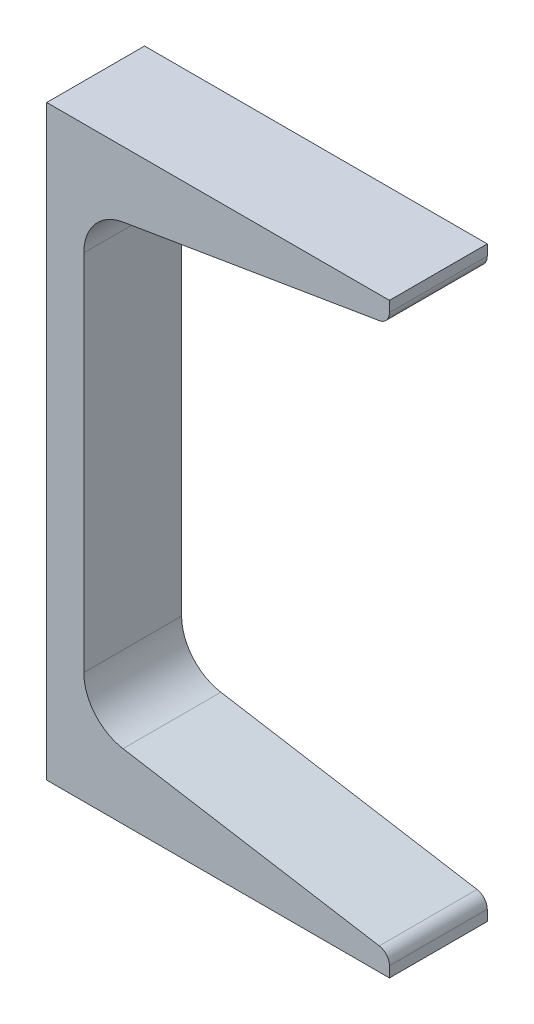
ISO-10303-21;
HEADER;
FILE_DESCRIPTION(('STEP AP214'),'2;1');
FILE_NAME('part.step','',(''),(''),'','','');
FILE_SCHEMA(('AUTOMOTIVE_DESIGN { 1 0 10303 214 1 1 1 1 }'));
ENDSEC;
DATA;
#1=APPLICATION_CONTEXT('core data for automotive mechanical design processes');
#2=APPLICATION_PROTOCOL_DEFINITION('international standard','automotive_design',2000,#1);
#3=PRODUCT_CONTEXT('',#1,'mechanical');
#4=PRODUCT('Part','Part','',(#3));
#5=PRODUCT_RELATED_PRODUCT_CATEGORY('part','',(#4));
#6=PRODUCT_DEFINITION_FORMATION('','',#4);
#7=PRODUCT_DEFINITION_CONTEXT('part definition',#1,'design');
#8=PRODUCT_DEFINITION('design','',#6,#7);
#9=PRODUCT_DEFINITION_SHAPE('','',#8);
#10=(LENGTH_UNIT() NAMED_UNIT(*) SI_UNIT(.MILLI.,.METRE.));
#11=(NAMED_UNIT(*) PLANE_ANGLE_UNIT() SI_UNIT($,.RADIAN.));
#12=(NAMED_UNIT(*) SI_UNIT($,.STERADIAN.) SOLID_ANGLE_UNIT());
#13=UNCERTAINTY_MEASURE_WITH_UNIT(LENGTH_MEASURE(1.E-05),#10,'distance_accuracy_value','');
#14=(GEOMETRIC_REPRESENTATION_CONTEXT(3) GLOBAL_UNCERTAINTY_ASSIGNED_CONTEXT((#13)) GLOBAL_UNIT_ASSIGNED_CONTEXT((#10,
#11,#12)) REPRESENTATION_CONTEXT('',''));
#15=CARTESIAN_POINT('',(0.,0.,0.));
#16=DIRECTION('',(0.,0.,1.));
#17=DIRECTION('',(1.,0.,0.));
#18=AXIS2_PLACEMENT_3D('',#15,#16,#17);
#19=CARTESIAN_POINT('',(0.,152.4,12.7));
#20=DIRECTION('',(1.,0.,0.));
#21=DIRECTION('',(0.,0.,-1.));
#22=AXIS2_PLACEMENT_3D('',#19,#20,#21);
#23=PLANE('',#22);
#24=DIRECTION('',(0.,-1.,0.));
#25=VECTOR('',#24,1.);
#26=CARTESIAN_POINT('',(0.,152.4,-12.7));
#27=LINE('',#26,#25);
#28=CARTESIAN_POINT('',(0.,152.4,-12.7));
#29=VERTEX_POINT('',#28);
#30=CARTESIAN_POINT('',(0.,0.,-12.7));
#31=VERTEX_POINT('',#30);
#32=EDGE_CURVE('E144',#29,#31,#27,.T.);
#33=ORIENTED_EDGE('',*,*,#32,.T.);
#34=DIRECTION('',(0.,0.,-1.));
#35=VECTOR('',#34,1.);
#36=CARTESIAN_POINT('',(0.,0.,12.7));
#37=LINE('',#36,#35);
#38=CARTESIAN_POINT('',(0.,0.,12.7));
#39=VERTEX_POINT('',#38);
#40=EDGE_CURVE('E142',#39,#31,#37,.T.);
#41=ORIENTED_EDGE('',*,*,#40,.F.);
#42=DIRECTION('',(0.,-1.,0.));
#43=VECTOR('',#42,1.);
#44=CARTESIAN_POINT('',(0.,152.4,12.7));
#45=LINE('',#44,#43);
#46=CARTESIAN_POINT('',(0.,152.4,12.7));
#47=VERTEX_POINT('',#46);
#48=EDGE_CURVE('E128',#47,#39,#45,.T.);
#49=ORIENTED_EDGE('',*,*,#48,.F.);
#50=DIRECTION('',(0.,0.,-1.));
#51=VECTOR('',#50,1.);
#52=CARTESIAN_POINT('',(0.,152.4,12.7));
#53=LINE('',#52,#51);
#54=EDGE_CURVE('E173',#47,#29,#53,.T.);
#55=ORIENTED_EDGE('',*,*,#54,.T.);
#56=EDGE_LOOP('',(#33,#41,#49,#55));
#57=FACE_BOUND('',#56,.T.);
#58=ADVANCED_FACE('F39',(#57),#23,.F.);
#59=CARTESIAN_POINT('',(89.0016,0.,12.7));
#60=DIRECTION('',(0.,-1.,0.));
#61=DIRECTION('',(1.,0.,0.));
#62=AXIS2_PLACEMENT_3D('',#59,#60,#61);
#63=PLANE('',#62);
#64=DIRECTION('',(-1.,0.,0.));
#65=VECTOR('',#64,1.);
#66=CARTESIAN_POINT('',(89.0016,0.,-12.7));
#67=LINE('',#66,#65);
#68=CARTESIAN_POINT('',(89.0016,0.,-12.7));
#69=VERTEX_POINT('',#68);
#70=EDGE_CURVE('E175',#69,#31,#67,.T.);
#71=ORIENTED_EDGE('',*,*,#70,.F.);
#72=DIRECTION('',(0.,0.,-1.));
#73=VECTOR('',#72,1.);
#74=CARTESIAN_POINT('',(89.0016,0.,12.7));
#75=LINE('',#74,#73);
#76=CARTESIAN_POINT('',(89.0016,0.,12.7));
#77=VERTEX_POINT('',#76);
#78=EDGE_CURVE('E149',#77,#69,#75,.T.);
#79=ORIENTED_EDGE('',*,*,#78,.F.);
#80=DIRECTION('',(-1.,0.,0.));
#81=VECTOR('',#80,1.);
#82=CARTESIAN_POINT('',(89.0016,0.,12.7));
#83=LINE('',#82,#81);
#84=EDGE_CURVE('E133',#77,#39,#83,.T.);
#85=ORIENTED_EDGE('',*,*,#84,.T.);
#86=ORIENTED_EDGE('',*,*,#40,.T.);
#87=EDGE_LOOP('',(#71,#79,#85,#86));
#88=FACE_BOUND('',#87,.T.);
#89=ADVANCED_FACE('F151',(#88),#63,.T.);
#90=CARTESIAN_POINT('',(89.0016,0.,12.7));
#91=DIRECTION('',(-1.,0.,0.));
#92=DIRECTION('',(0.,-1.,0.));
#93=AXIS2_PLACEMENT_3D('',#90,#91,#92);
#94=PLANE('',#93);
#95=DIRECTION('',(0.,1.,0.));
#96=VECTOR('',#95,1.);
#97=CARTESIAN_POINT('',(89.0016,0.,-12.7));
#98=LINE('',#97,#96);
#99=CARTESIAN_POINT('',(89.0016,2.76033787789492,-12.7));
#100=VERTEX_POINT('',#99);
#101=EDGE_CURVE('E177',#69,#100,#98,.T.);
#102=ORIENTED_EDGE('',*,*,#101,.T.);
#103=DIRECTION('',(0.,0.,-1.));
#104=VECTOR('',#103,1.);
#105=CARTESIAN_POINT('',(89.0016,2.76033787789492,12.7));
#106=LINE('',#105,#104);
#107=CARTESIAN_POINT('',(89.0016,2.76033787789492,12.7));
#108=VERTEX_POINT('',#107);
#109=EDGE_CURVE('E216',#100,#108,#106,.F.);
#110=ORIENTED_EDGE('',*,*,#109,.T.);
#111=DIRECTION('',(0.,1.,0.));
#112=VECTOR('',#111,1.);
#113=CARTESIAN_POINT('',(89.0016,0.,12.7));
#114=LINE('',#113,#112);
#115=EDGE_CURVE('E153',#77,#108,#114,.T.);
#116=ORIENTED_EDGE('',*,*,#115,.F.);
#117=ORIENTED_EDGE('',*,*,#78,.T.);
#118=EDGE_LOOP('',(#102,#110,#116,#117));
#119=FACE_BOUND('',#118,.T.);
#120=ADVANCED_FACE('F249',(#119),#94,.F.);
#121=CARTESIAN_POINT('',(19.8141052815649,16.9820244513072,12.7));
#122=DIRECTION('',(0.164410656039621,0.986391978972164,0.));
#123=DIRECTION('',(-0.986391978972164,0.164410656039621,0.));
#124=AXIS2_PLACEMENT_3D('',#121,#122,#123);
#125=PLANE('',#124);
#126=DIRECTION('',(0.986391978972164,-0.164410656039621,0.));
#127=VECTOR('',#126,1.);
#128=CARTESIAN_POINT('',(19.8141052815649,16.9820244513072,12.7));
#129=LINE('',#128,#127);
#130=CARTESIAN_POINT('',(19.8141052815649,16.9820244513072,12.7));
#131=VERTEX_POINT('',#130);
#132=CARTESIAN_POINT('',(86.3486038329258,5.89213241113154,12.7));
#133=VERTEX_POINT('',#132);
#134=EDGE_CURVE('E155',#131,#133,#129,.T.);
#135=ORIENTED_EDGE('',*,*,#134,.T.);
#136=DIRECTION('',(0.,0.,-1.));
#137=VECTOR('',#136,1.);
#138=CARTESIAN_POINT('',(86.3486038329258,5.89213241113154,-12.7));
#139=LINE('',#138,#137);
#140=CARTESIAN_POINT('',(86.3486038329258,5.89213241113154,-12.7));
#141=VERTEX_POINT('',#140);
#142=EDGE_CURVE('E148',#133,#141,#139,.T.);
#143=ORIENTED_EDGE('',*,*,#142,.T.);
#144=DIRECTION('',(0.986391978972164,-0.164410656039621,0.));
#145=VECTOR('',#144,1.);
#146=CARTESIAN_POINT('',(19.8141052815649,16.9820244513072,-12.7));
#147=LINE('',#146,#145);
#148=CARTESIAN_POINT('',(19.8141052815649,16.9820244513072,-12.7));
#149=VERTEX_POINT('',#148);
#150=EDGE_CURVE('E180',#149,#141,#147,.T.);
#151=ORIENTED_EDGE('',*,*,#150,.F.);
#152=DIRECTION('',(0.,0.,-1.));
#153=VECTOR('',#152,1.);
#154=CARTESIAN_POINT('',(19.8141052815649,16.9820244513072,12.7));
#155=LINE('',#154,#153);
#156=EDGE_CURVE('E207',#131,#149,#155,.T.);
#157=ORIENTED_EDGE('',*,*,#156,.F.);
#158=EDGE_LOOP('',(#135,#143,#151,#157));
#159=FACE_BOUND('',#158,.T.);
#160=ADVANCED_FACE('F265',(#159),#125,.T.);
#161=CARTESIAN_POINT('',(21.8186,29.0081154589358,12.7));
#162=DIRECTION('',(0.,0.,-1.));
#163=DIRECTION('',(-1.,0.,0.));
#164=AXIS2_PLACEMENT_3D('',#161,#162,#163);
#165=CYLINDRICAL_SURFACE('',#164,12.192);
#166=CARTESIAN_POINT('',(21.8186,29.0081154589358,-12.7));
#167=DIRECTION('',(0.,0.,1.));
#168=DIRECTION('',(1.,0.,0.));
#169=AXIS2_PLACEMENT_3D('',#166,#167,#168);
#170=CIRCLE('',#169,12.192);
#171=CARTESIAN_POINT('',(9.62660000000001,29.0081154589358,-12.7));
#172=VERTEX_POINT('',#171);
#173=EDGE_CURVE('E183',#172,#149,#170,.T.);
#174=ORIENTED_EDGE('',*,*,#173,.F.);
#175=DIRECTION('',(0.,0.,-1.));
#176=VECTOR('',#175,1.);
#177=CARTESIAN_POINT('',(9.62660000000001,29.0081154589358,12.7));
#178=LINE('',#177,#176);
#179=CARTESIAN_POINT('',(9.62660000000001,29.0081154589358,12.7));
#180=VERTEX_POINT('',#179);
#181=EDGE_CURVE('E205',#180,#172,#178,.T.);
#182=ORIENTED_EDGE('',*,*,#181,.F.);
#183=CARTESIAN_POINT('',(21.8186,29.0081154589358,12.7));
#184=DIRECTION('',(0.,0.,1.));
#185=DIRECTION('',(1.,0.,0.));
#186=AXIS2_PLACEMENT_3D('',#183,#184,#185);
#187=CIRCLE('',#186,12.192);
#188=EDGE_CURVE('E160',#180,#131,#187,.T.);
#189=ORIENTED_EDGE('',*,*,#188,.T.);
#190=ORIENTED_EDGE('',*,*,#156,.T.);
#191=EDGE_LOOP('',(#174,#182,#189,#190));
#192=FACE_BOUND('',#191,.T.);
#193=ADVANCED_FACE('F269',(#192),#165,.F.);
#194=CARTESIAN_POINT('',(9.62660000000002,123.391884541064,12.7));
#195=DIRECTION('',(1.,0.,0.));
#196=DIRECTION('',(0.,1.,0.));
#197=AXIS2_PLACEMENT_3D('',#194,#195,#196);
#198=PLANE('',#197);
#199=DIRECTION('',(0.,-1.,0.));
#200=VECTOR('',#199,1.);
#201=CARTESIAN_POINT('',(9.62660000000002,123.391884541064,-12.7));
#202=LINE('',#201,#200);
#203=CARTESIAN_POINT('',(9.62660000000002,123.391884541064,-12.7));
#204=VERTEX_POINT('',#203);
#205=EDGE_CURVE('E186',#204,#172,#202,.T.);
#206=ORIENTED_EDGE('',*,*,#205,.F.);
#207=DIRECTION('',(0.,0.,-1.));
#208=VECTOR('',#207,1.);
#209=CARTESIAN_POINT('',(9.62660000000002,123.391884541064,12.7));
#210=LINE('',#209,#208);
#211=CARTESIAN_POINT('',(9.62660000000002,123.391884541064,12.7));
#212=VERTEX_POINT('',#211);
#213=EDGE_CURVE('E203',#212,#204,#210,.T.);
#214=ORIENTED_EDGE('',*,*,#213,.F.);
#215=DIRECTION('',(0.,-1.,0.));
#216=VECTOR('',#215,1.);
#217=CARTESIAN_POINT('',(9.62660000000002,123.391884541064,12.7));
#218=LINE('',#217,#216);
#219=EDGE_CURVE('E163',#212,#180,#218,.T.);
#220=ORIENTED_EDGE('',*,*,#219,.T.);
#221=ORIENTED_EDGE('',*,*,#181,.T.);
#222=EDGE_LOOP('',(#206,#214,#220,#221));
#223=FACE_BOUND('',#222,.T.);
#224=ADVANCED_FACE('F273',(#223),#198,.T.);
#225=CARTESIAN_POINT('',(21.8186,123.391884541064,12.7));
#226=DIRECTION('',(0.,0.,-1.));
#227=DIRECTION('',(-1.,0.,0.));
#228=AXIS2_PLACEMENT_3D('',#225,#226,#227);
#229=CYLINDRICAL_SURFACE('',#228,12.192);
#230=CARTESIAN_POINT('',(21.8186,123.391884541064,-12.7));
#231=DIRECTION('',(0.,0.,-1.));
#232=DIRECTION('',(-1.,0.,0.));
#233=AXIS2_PLACEMENT_3D('',#230,#231,#232);
#234=CIRCLE('',#233,12.192);
#235=CARTESIAN_POINT('',(19.8141052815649,135.417975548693,-12.7));
#236=VERTEX_POINT('',#235);
#237=EDGE_CURVE('E189',#204,#236,#234,.T.);
#238=ORIENTED_EDGE('',*,*,#237,.T.);
#239=DIRECTION('',(0.,0.,-1.));
#240=VECTOR('',#239,1.);
#241=CARTESIAN_POINT('',(19.8141052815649,135.417975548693,12.7));
#242=LINE('',#241,#240);
#243=CARTESIAN_POINT('',(19.8141052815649,135.417975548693,12.7));
#244=VERTEX_POINT('',#243);
#245=EDGE_CURVE('E200',#244,#236,#242,.T.);
#246=ORIENTED_EDGE('',*,*,#245,.F.);
#247=CARTESIAN_POINT('',(21.8186,123.391884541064,12.7));
#248=DIRECTION('',(0.,0.,-1.));
#249=DIRECTION('',(-1.,0.,0.));
#250=AXIS2_PLACEMENT_3D('',#247,#248,#249);
#251=CIRCLE('',#250,12.192);
#252=EDGE_CURVE('E166',#212,#244,#251,.T.);
#253=ORIENTED_EDGE('',*,*,#252,.F.);
#254=ORIENTED_EDGE('',*,*,#213,.T.);
#255=EDGE_LOOP('',(#238,#246,#253,#254));
#256=FACE_BOUND('',#255,.T.);
#257=ADVANCED_FACE('F278',(#256),#229,.F.);
#258=CARTESIAN_POINT('',(19.8141052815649,135.417975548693,12.7));
#259=DIRECTION('',(-0.164410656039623,0.986391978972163,0.));
#260=DIRECTION('',(-0.986391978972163,-0.164410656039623,0.));
#261=AXIS2_PLACEMENT_3D('',#258,#259,#260);
#262=PLANE('',#261);
#263=DIRECTION('',(0.986391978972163,0.164410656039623,0.));
#264=VECTOR('',#263,1.);
#265=CARTESIAN_POINT('',(19.8141052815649,135.417975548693,-12.7));
#266=LINE('',#265,#264);
#267=CARTESIAN_POINT('',(86.3486038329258,146.507867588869,-12.7));
#268=VERTEX_POINT('',#267);
#269=EDGE_CURVE('E191',#236,#268,#266,.T.);
#270=ORIENTED_EDGE('',*,*,#269,.T.);
#271=DIRECTION('',(0.,0.,-1.));
#272=VECTOR('',#271,1.);
#273=CARTESIAN_POINT('',(86.3486038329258,146.507867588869,12.7));
#274=LINE('',#273,#272);
#275=CARTESIAN_POINT('',(86.3486038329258,146.507867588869,12.7));
#276=VERTEX_POINT('',#275);
#277=EDGE_CURVE('E11',#268,#276,#274,.F.);
#278=ORIENTED_EDGE('',*,*,#277,.T.);
#279=DIRECTION('',(0.986391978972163,0.164410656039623,0.));
#280=VECTOR('',#279,1.);
#281=CARTESIAN_POINT('',(19.8141052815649,135.417975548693,12.7));
#282=LINE('',#281,#280);
#283=EDGE_CURVE('E168',#244,#276,#282,.T.);
#284=ORIENTED_EDGE('',*,*,#283,.F.);
#285=ORIENTED_EDGE('',*,*,#245,.T.);
#286=EDGE_LOOP('',(#270,#278,#284,#285));
#287=FACE_BOUND('',#286,.T.);
#288=ADVANCED_FACE('F241',(#287),#262,.F.);
#289=CARTESIAN_POINT('',(89.0016,152.4,12.7));
#290=DIRECTION('',(1.,0.,0.));
#291=DIRECTION('',(0.,1.,0.));
#292=AXIS2_PLACEMENT_3D('',#289,#290,#291);
#293=PLANE('',#292);
#294=DIRECTION('',(0.,-1.,0.));
#295=VECTOR('',#294,1.);
#296=CARTESIAN_POINT('',(89.0016,152.4,12.7));
#297=LINE('',#296,#295);
#298=CARTESIAN_POINT('',(89.0016,152.4,12.7));
#299=VERTEX_POINT('',#298);
#300=CARTESIAN_POINT('',(89.0016,149.639662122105,12.7));
#301=VERTEX_POINT('',#300);
#302=EDGE_CURVE('E170',#299,#301,#297,.T.);
#303=ORIENTED_EDGE('',*,*,#302,.T.);
#304=DIRECTION('',(0.,0.,-1.));
#305=VECTOR('',#304,1.);
#306=CARTESIAN_POINT('',(89.0016,149.639662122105,-12.7));
#307=LINE('',#306,#305);
#308=CARTESIAN_POINT('',(89.0016,149.639662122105,-12.7));
#309=VERTEX_POINT('',#308);
#310=EDGE_CURVE('E47',#301,#309,#307,.T.);
#311=ORIENTED_EDGE('',*,*,#310,.T.);
#312=DIRECTION('',(0.,-1.,0.));
#313=VECTOR('',#312,1.);
#314=CARTESIAN_POINT('',(89.0016,152.4,-12.7));
#315=LINE('',#314,#313);
#316=CARTESIAN_POINT('',(89.0016,152.4,-12.7));
#317=VERTEX_POINT('',#316);
#318=EDGE_CURVE('E193',#317,#309,#315,.T.);
#319=ORIENTED_EDGE('',*,*,#318,.F.);
#320=DIRECTION('',(0.,0.,-1.));
#321=VECTOR('',#320,1.);
#322=CARTESIAN_POINT('',(89.0016,152.4,12.7));
#323=LINE('',#322,#321);
#324=EDGE_CURVE('E198',#299,#317,#323,.T.);
#325=ORIENTED_EDGE('',*,*,#324,.F.);
#326=EDGE_LOOP('',(#303,#311,#319,#325));
#327=FACE_BOUND('',#326,.T.);
#328=ADVANCED_FACE('F224',(#327),#293,.T.);
#329=CARTESIAN_POINT('',(89.0016,152.4,12.7));
#330=DIRECTION('',(0.,-1.,0.));
#331=DIRECTION('',(0.,0.,-1.));
#332=AXIS2_PLACEMENT_3D('',#329,#330,#331);
#333=PLANE('',#332);
#334=DIRECTION('',(-1.,0.,0.));
#335=VECTOR('',#334,1.);
#336=CARTESIAN_POINT('',(89.0016,152.4,-12.7));
#337=LINE('',#336,#335);
#338=EDGE_CURVE('E139',#317,#29,#337,.T.);
#339=ORIENTED_EDGE('',*,*,#338,.T.);
#340=ORIENTED_EDGE('',*,*,#54,.F.);
#341=DIRECTION('',(-1.,0.,0.));
#342=VECTOR('',#341,1.);
#343=CARTESIAN_POINT('',(89.0016,152.4,12.7));
#344=LINE('',#343,#342);
#345=EDGE_CURVE('E135',#299,#47,#344,.T.);
#346=ORIENTED_EDGE('',*,*,#345,.F.);
#347=ORIENTED_EDGE('',*,*,#324,.T.);
#348=EDGE_LOOP('',(#339,#340,#346,#347));
#349=FACE_BOUND('',#348,.T.);
#350=ADVANCED_FACE('F231',(#349),#333,.F.);
#351=CARTESIAN_POINT('',(21.8186,29.0081154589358,12.7));
#352=DIRECTION('',(0.,0.,1.));
#353=DIRECTION('',(1.,0.,0.));
#354=AXIS2_PLACEMENT_3D('',#351,#352,#353);
#355=PLANE('',#354);
#356=ORIENTED_EDGE('',*,*,#115,.T.);
#357=CARTESIAN_POINT('',(85.8266,2.76033787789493,12.7));
#358=DIRECTION('',(0.,0.,1.));
#359=DIRECTION('',(1.,0.,0.));
#360=AXIS2_PLACEMENT_3D('',#357,#358,#359);
#361=CIRCLE('',#360,3.175);
#362=EDGE_CURVE('E219',#108,#133,#361,.T.);
#363=ORIENTED_EDGE('',*,*,#362,.T.);
#364=ORIENTED_EDGE('',*,*,#134,.F.);
#365=ORIENTED_EDGE('',*,*,#188,.F.);
#366=ORIENTED_EDGE('',*,*,#219,.F.);
#367=ORIENTED_EDGE('',*,*,#252,.T.);
#368=ORIENTED_EDGE('',*,*,#283,.T.);
#369=CARTESIAN_POINT('',(85.8266,149.639662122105,12.7));
#370=DIRECTION('',(0.,0.,1.));
#371=DIRECTION('',(1.,0.,0.));
#372=AXIS2_PLACEMENT_3D('',#369,#370,#371);
#373=CIRCLE('',#372,3.175);
#374=EDGE_CURVE('E54',#276,#301,#373,.T.);
#375=ORIENTED_EDGE('',*,*,#374,.T.);
#376=ORIENTED_EDGE('',*,*,#302,.F.);
#377=ORIENTED_EDGE('',*,*,#345,.T.);
#378=ORIENTED_EDGE('',*,*,#48,.T.);
#379=ORIENTED_EDGE('',*,*,#84,.F.);
#380=EDGE_LOOP('',(#356,#363,#364,#365,#366,#367,#368,#375,#376,#377,#378,#379));
#381=FACE_BOUND('',#380,.T.);
#382=ADVANCED_FACE('F131',(#381),#355,.T.);
#383=CARTESIAN_POINT('',(21.8186,29.0081154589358,-12.7));
#384=DIRECTION('',(0.,0.,1.));
#385=DIRECTION('',(1.,0.,0.));
#386=AXIS2_PLACEMENT_3D('',#383,#384,#385);
#387=PLANE('',#386);
#388=ORIENTED_EDGE('',*,*,#150,.T.);
#389=CARTESIAN_POINT('',(85.8266,2.76033787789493,-12.7));
#390=DIRECTION('',(0.,0.,1.));
#391=DIRECTION('',(1.,0.,0.));
#392=AXIS2_PLACEMENT_3D('',#389,#390,#391);
#393=CIRCLE('',#392,3.175);
#394=EDGE_CURVE('E214',#141,#100,#393,.F.);
#395=ORIENTED_EDGE('',*,*,#394,.T.);
#396=ORIENTED_EDGE('',*,*,#101,.F.);
#397=ORIENTED_EDGE('',*,*,#70,.T.);
#398=ORIENTED_EDGE('',*,*,#32,.F.);
#399=ORIENTED_EDGE('',*,*,#338,.F.);
#400=ORIENTED_EDGE('',*,*,#318,.T.);
#401=CARTESIAN_POINT('',(85.8266,149.639662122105,-12.7));
#402=DIRECTION('',(0.,0.,1.));
#403=DIRECTION('',(1.,0.,0.));
#404=AXIS2_PLACEMENT_3D('',#401,#402,#403);
#405=CIRCLE('',#404,3.175);
#406=EDGE_CURVE('E212',#309,#268,#405,.F.);
#407=ORIENTED_EDGE('',*,*,#406,.T.);
#408=ORIENTED_EDGE('',*,*,#269,.F.);
#409=ORIENTED_EDGE('',*,*,#237,.F.);
#410=ORIENTED_EDGE('',*,*,#205,.T.);
#411=ORIENTED_EDGE('',*,*,#173,.T.);
#412=EDGE_LOOP('',(#388,#395,#396,#397,#398,#399,#400,#407,#408,#409,#410,#411));
#413=FACE_BOUND('',#412,.T.);
#414=ADVANCED_FACE('F228',(#413),#387,.F.);
#415=CARTESIAN_POINT('',(85.8266,2.76033787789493,12.7));
#416=DIRECTION('',(0.,0.,1.));
#417=DIRECTION('',(1.,0.,0.));
#418=AXIS2_PLACEMENT_3D('',#415,#416,#417);
#419=CYLINDRICAL_SURFACE('',#418,3.175);
#420=ORIENTED_EDGE('',*,*,#362,.F.);
#421=ORIENTED_EDGE('',*,*,#109,.F.);
#422=ORIENTED_EDGE('',*,*,#394,.F.);
#423=ORIENTED_EDGE('',*,*,#142,.F.);
#424=EDGE_LOOP('',(#420,#421,#422,#423));
#425=FACE_BOUND('',#424,.T.);
#426=ADVANCED_FACE('F252',(#425),#419,.T.);
#427=CARTESIAN_POINT('',(85.8266,149.639662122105,12.7));
#428=DIRECTION('',(0.,0.,1.));
#429=DIRECTION('',(1.,0.,0.));
#430=AXIS2_PLACEMENT_3D('',#427,#428,#429);
#431=CYLINDRICAL_SURFACE('',#430,3.175);
#432=ORIENTED_EDGE('',*,*,#374,.F.);
#433=ORIENTED_EDGE('',*,*,#277,.F.);
#434=ORIENTED_EDGE('',*,*,#406,.F.);
#435=ORIENTED_EDGE('',*,*,#310,.F.);
#436=EDGE_LOOP('',(#432,#433,#434,#435));
#437=FACE_BOUND('',#436,.T.);
#438=ADVANCED_FACE('F41',(#437),#431,.T.);
#439=CLOSED_SHELL('',(#58,#89,#120,#160,#193,#224,#257,#288,#328,#350,#382,#414,#426,#438));
#440=MANIFOLD_SOLID_BREP('B2',#439);
#441=ADVANCED_BREP_SHAPE_REPRESENTATION('',(#18,#440),#14);
#442=SHAPE_DEFINITION_REPRESENTATION(#9,#441);
ENDSEC;
END-ISO-10303-21;
